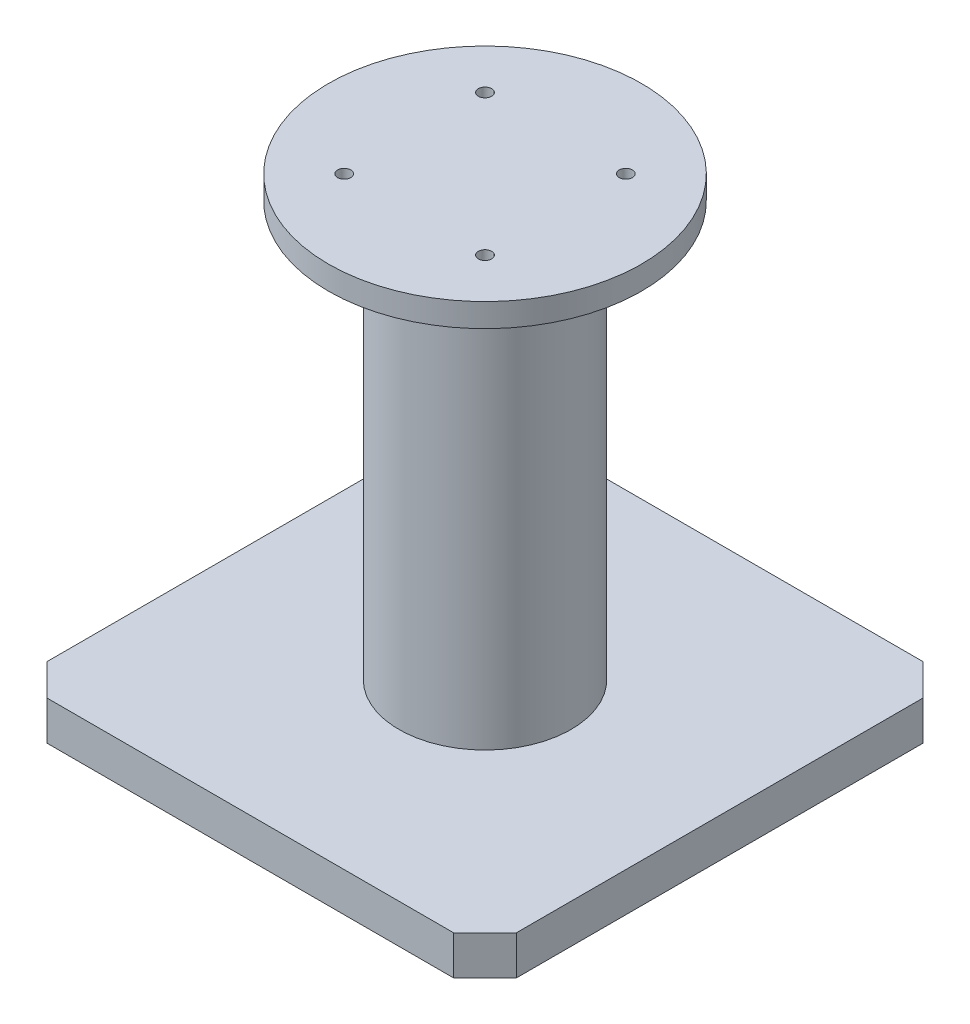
from build123d import *

# Parameters (mm, degrees)
SKETCH1_R           = 100
BOSS_EXTRUDE1_DEPTH = 15
SKETCH2_R           = 55
BOSS_EXTRUDE2_DEPTH = 265
BOSS_EXTRUDE3_DEPTH = 25
SKETCH4_R           = 4.25
CUT_EXTRUDE1_DEPTH  = 25


with BuildPart() as part:
    # Sketch1 → Boss-Extrude1 (new body)
    with BuildSketch(Plane(origin=(0, 0, 0), x_dir=(1, 0, 0), z_dir=(0, 1, 0))):
        with Locations(Location((0, 0, 0), (0, 0, 270))):
            Circle(SKETCH1_R)
    extrude(amount=-BOSS_EXTRUDE1_DEPTH)

    # Sketch2 → Boss-Extrude2 (add)
    with BuildSketch(Plane.XZ.offset(15)):
        with Locations(Location((0, 0, 0), (0, 0, 270))):
            Circle(SKETCH2_R)
    extrude(amount=BOSS_EXTRUDE2_DEPTH)

    # Sketch3 → Boss-Extrude3 (add)
    with BuildSketch(Plane.XZ.offset(280)):
        Polygon((-150, 130), (-130, 150), (130, 150), (150, 130), (150, -130), (130, -150), (-130, -150), (-150, -130), align=None)
    extrude(amount=BOSS_EXTRUDE3_DEPTH)

    # Sketch4 → Cut-Extrude1 (cut)
    with BuildSketch(Plane(origin=(0, 0, 0), x_dir=(1, 0, 0), z_dir=(0, 1, 0))):
        with Locations(Location((-45, 45, 0), (0, 0, 270))):
            Circle(SKETCH4_R)
        with Locations(Location((45, 45, 0), (0, 0, 270))):
            Circle(SKETCH4_R)
        with Locations(Location((45, -45, 0), (0, 0, 270))):
            Circle(SKETCH4_R)
        with Locations(Location((-45, -45, 0), (0, 0, 270))):
            Circle(SKETCH4_R)
    extrude(amount=-CUT_EXTRUDE1_DEPTH, mode=Mode.SUBTRACT)


solid = part.part
